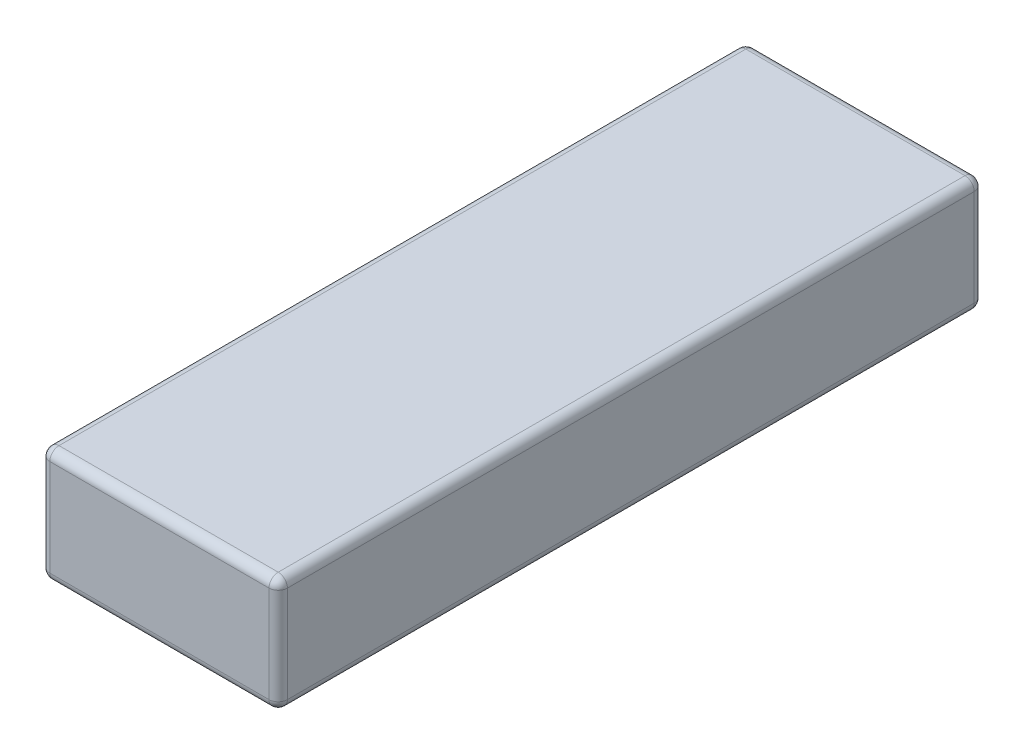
from build123d import *

# Parameters (mm, degrees)
SKETCH1_W           = 77.5
SKETCH1_H           = 37.5
BOSS_EXTRUDE1_DEPTH = 115
FILLET1_R           = 3


with BuildPart() as part:
    # Sketch1 → Boss-Extrude1 (new, symmetric)
    with BuildSketch(Plane.XY):
        Rectangle(SKETCH1_W, SKETCH1_H)
    extrude(amount=BOSS_EXTRUDE1_DEPTH, both=True)

    # Fillet1
    fillet1_edges = [part.edges().sort_by_distance(p)[0] for p in [
        (-38.75, 0, 115),
        (0, -18.75, 115),
        (38.75, 0, 115),
        (0, -18.75, -115),
        (-38.75, 0, -115),
        (0, 18.75, -115),
        (38.75, 0, -115),
        (38.75, -18.75, 0),
        (-38.75, -18.75, 0),
        (-38.75, 18.75, 0),
        (38.75, 18.75, 0),
        (0, 18.75, 115),
    ]]
    fillet(fillet1_edges, radius=FILLET1_R)


solid = part.part
